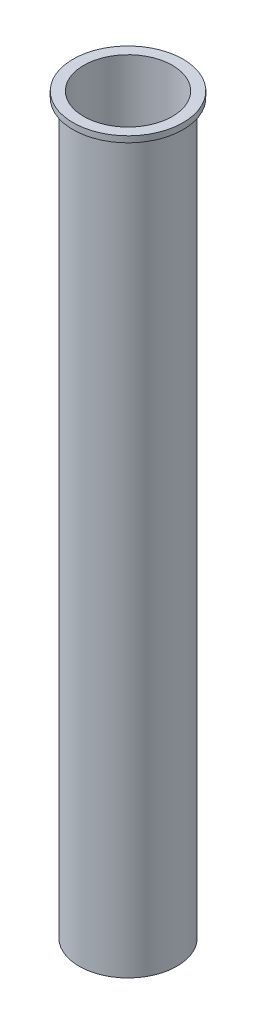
ISO-10303-21;
HEADER;
FILE_DESCRIPTION(('STEP AP214'),'2;1');
FILE_NAME('part.step','',(''),(''),'','','');
FILE_SCHEMA(('AUTOMOTIVE_DESIGN { 1 0 10303 214 1 1 1 1 }'));
ENDSEC;
DATA;
#1=APPLICATION_CONTEXT('core data for automotive mechanical design processes');
#2=APPLICATION_PROTOCOL_DEFINITION('international standard','automotive_design',2000,#1);
#3=PRODUCT_CONTEXT('',#1,'mechanical');
#4=PRODUCT('Part','Part','',(#3));
#5=PRODUCT_RELATED_PRODUCT_CATEGORY('part','',(#4));
#6=PRODUCT_DEFINITION_FORMATION('','',#4);
#7=PRODUCT_DEFINITION_CONTEXT('part definition',#1,'design');
#8=PRODUCT_DEFINITION('design','',#6,#7);
#9=PRODUCT_DEFINITION_SHAPE('','',#8);
#10=(LENGTH_UNIT() NAMED_UNIT(*) SI_UNIT(.MILLI.,.METRE.));
#11=(NAMED_UNIT(*) PLANE_ANGLE_UNIT() SI_UNIT($,.RADIAN.));
#12=(NAMED_UNIT(*) SI_UNIT($,.STERADIAN.) SOLID_ANGLE_UNIT());
#13=UNCERTAINTY_MEASURE_WITH_UNIT(LENGTH_MEASURE(1.E-05),#10,'distance_accuracy_value','');
#14=(GEOMETRIC_REPRESENTATION_CONTEXT(3) GLOBAL_UNCERTAINTY_ASSIGNED_CONTEXT((#13)) GLOBAL_UNIT_ASSIGNED_CONTEXT((#10,
#11,#12)) REPRESENTATION_CONTEXT('',''));
#15=CARTESIAN_POINT('',(0.,0.,0.));
#16=DIRECTION('',(0.,0.,1.));
#17=DIRECTION('',(1.,0.,0.));
#18=AXIS2_PLACEMENT_3D('',#15,#16,#17);
#19=CARTESIAN_POINT('',(0.,0.,0.));
#20=DIRECTION('',(0.,-1.,0.));
#21=DIRECTION('',(0.,0.,-1.));
#22=AXIS2_PLACEMENT_3D('',#19,#20,#21);
#23=CYLINDRICAL_SURFACE('',#22,114.3);
#24=CARTESIAN_POINT('',(0.,0.,0.));
#25=DIRECTION('',(0.,-1.,0.));
#26=DIRECTION('',(0.,0.,-1.));
#27=AXIS2_PLACEMENT_3D('',#24,#25,#26);
#28=CIRCLE('',#27,114.3);
#29=CARTESIAN_POINT('',(0.,0.,-114.3));
#30=VERTEX_POINT('',#29);
#31=EDGE_CURVE('E62',#30,#30,#28,.T.);
#32=ORIENTED_EDGE('',*,*,#31,.T.);
#33=EDGE_LOOP('',(#32));
#34=FACE_BOUND('',#33,.T.);
#35=CARTESIAN_POINT('',(0.,-12.7,0.));
#36=DIRECTION('',(0.,-1.,0.));
#37=DIRECTION('',(0.,0.,-1.));
#38=AXIS2_PLACEMENT_3D('',#35,#36,#37);
#39=CIRCLE('',#38,114.3);
#40=CARTESIAN_POINT('',(0.,-12.7,-114.3));
#41=VERTEX_POINT('',#40);
#42=EDGE_CURVE('E10',#41,#41,#39,.T.);
#43=ORIENTED_EDGE('',*,*,#42,.F.);
#44=EDGE_LOOP('',(#43));
#45=FACE_BOUND('',#44,.T.);
#46=ADVANCED_FACE('F31',(#34,#45),#23,.T.);
#47=CARTESIAN_POINT('',(0.,-12.7,-114.3));
#48=DIRECTION('',(0.,-1.,0.));
#49=DIRECTION('',(0.,0.,-1.));
#50=AXIS2_PLACEMENT_3D('',#47,#48,#49);
#51=PLANE('',#50);
#52=ORIENTED_EDGE('',*,*,#42,.T.);
#53=EDGE_LOOP('',(#52));
#54=FACE_BOUND('',#53,.T.);
#55=CARTESIAN_POINT('',(0.,-12.7,0.));
#56=DIRECTION('',(0.,-1.,0.));
#57=DIRECTION('',(0.,0.,-1.));
#58=AXIS2_PLACEMENT_3D('',#55,#56,#57);
#59=CIRCLE('',#58,101.6);
#60=CARTESIAN_POINT('',(0.,-12.7,-101.6));
#61=VERTEX_POINT('',#60);
#62=EDGE_CURVE('E37',#61,#61,#59,.T.);
#63=ORIENTED_EDGE('',*,*,#62,.F.);
#64=EDGE_LOOP('',(#63));
#65=FACE_BOUND('',#64,.T.);
#66=ADVANCED_FACE('F85',(#54,#65),#51,.T.);
#67=CARTESIAN_POINT('',(0.,0.,0.));
#68=DIRECTION('',(0.,-1.,0.));
#69=DIRECTION('',(0.,0.,-1.));
#70=AXIS2_PLACEMENT_3D('',#67,#68,#69);
#71=CYLINDRICAL_SURFACE('',#70,101.6);
#72=ORIENTED_EDGE('',*,*,#62,.T.);
#73=EDGE_LOOP('',(#72));
#74=FACE_BOUND('',#73,.T.);
#75=CARTESIAN_POINT('',(0.,-1524.,0.));
#76=DIRECTION('',(0.,-1.,0.));
#77=DIRECTION('',(0.,0.,-1.));
#78=AXIS2_PLACEMENT_3D('',#75,#76,#77);
#79=CIRCLE('',#78,101.6);
#80=CARTESIAN_POINT('',(0.,-1524.,-101.6));
#81=VERTEX_POINT('',#80);
#82=EDGE_CURVE('E41',#81,#81,#79,.T.);
#83=ORIENTED_EDGE('',*,*,#82,.F.);
#84=EDGE_LOOP('',(#83));
#85=FACE_BOUND('',#84,.T.);
#86=ADVANCED_FACE('F82',(#74,#85),#71,.T.);
#87=CARTESIAN_POINT('',(0.,-1524.,-101.6));
#88=DIRECTION('',(0.,-1.,0.));
#89=DIRECTION('',(0.,0.,-1.));
#90=AXIS2_PLACEMENT_3D('',#87,#88,#89);
#91=PLANE('',#90);
#92=ORIENTED_EDGE('',*,*,#82,.T.);
#93=EDGE_LOOP('',(#92));
#94=FACE_BOUND('',#93,.T.);
#95=CARTESIAN_POINT('',(0.,-1524.,0.));
#96=DIRECTION('',(0.,-1.,0.));
#97=DIRECTION('',(0.,0.,-1.));
#98=AXIS2_PLACEMENT_3D('',#95,#96,#97);
#99=CIRCLE('',#98,96.5233767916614);
#100=CARTESIAN_POINT('',(0.,-1524.,-96.5233767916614));
#101=VERTEX_POINT('',#100);
#102=EDGE_CURVE('E45',#101,#101,#99,.T.);
#103=ORIENTED_EDGE('',*,*,#102,.F.);
#104=EDGE_LOOP('',(#103));
#105=FACE_BOUND('',#104,.T.);
#106=ADVANCED_FACE('F77',(#94,#105),#91,.T.);
#107=CARTESIAN_POINT('',(0.,-1460.5,-12.7));
#108=CARTESIAN_POINT('',(0.,-1481.26134861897,-12.7));
#109=CARTESIAN_POINT('',(0.,-1525.21465995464,-25.1026093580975));
#110=CARTESIAN_POINT('',(0.,-1524.,-71.1785006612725));
#111=CARTESIAN_POINT('',(0.,-1524.,-96.5233767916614));
#112=B_SPLINE_CURVE_WITH_KNOTS('',3,(#107,#108,#109,#110,#111),.UNSPECIFIED.,.F.,.F.,(4,1,4),
(0.,0.444656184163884,1.),.UNSPECIFIED.);
#113=CARTESIAN_POINT('',(0.,0.,0.));
#114=DIRECTION('',(0.,-1.,0.));
#115=AXIS1_PLACEMENT('',#113,#114);
#116=SURFACE_OF_REVOLUTION('',#112,#115);
#117=ORIENTED_EDGE('',*,*,#102,.T.);
#118=EDGE_LOOP('',(#117));
#119=FACE_BOUND('',#118,.T.);
#120=CARTESIAN_POINT('',(0.,-1460.5,0.));
#121=DIRECTION('',(0.,-1.,0.));
#122=DIRECTION('',(0.,0.,-1.));
#123=AXIS2_PLACEMENT_3D('',#120,#121,#122);
#124=CIRCLE('',#123,12.7);
#125=CARTESIAN_POINT('',(0.,-1460.5,-12.7));
#126=VERTEX_POINT('',#125);
#127=EDGE_CURVE('E50',#126,#126,#124,.T.);
#128=ORIENTED_EDGE('',*,*,#127,.F.);
#129=EDGE_LOOP('',(#128));
#130=FACE_BOUND('',#129,.T.);
#131=ADVANCED_FACE('F72',(#119,#130),#116,.F.);
#132=CARTESIAN_POINT('',(0.,0.,0.));
#133=DIRECTION('',(0.,-1.,0.));
#134=DIRECTION('',(0.,0.,-1.));
#135=AXIS2_PLACEMENT_3D('',#132,#133,#134);
#136=CYLINDRICAL_SURFACE('',#135,12.7);
#137=ORIENTED_EDGE('',*,*,#127,.T.);
#138=EDGE_LOOP('',(#137));
#139=FACE_BOUND('',#138,.T.);
#140=CARTESIAN_POINT('',(0.,-1447.8,0.));
#141=DIRECTION('',(0.,-1.,0.));
#142=DIRECTION('',(0.,0.,-1.));
#143=AXIS2_PLACEMENT_3D('',#140,#141,#142);
#144=CIRCLE('',#143,12.7);
#145=CARTESIAN_POINT('',(0.,-1447.8,-12.7));
#146=VERTEX_POINT('',#145);
#147=EDGE_CURVE('E53',#146,#146,#144,.T.);
#148=ORIENTED_EDGE('',*,*,#147,.F.);
#149=EDGE_LOOP('',(#148));
#150=FACE_BOUND('',#149,.T.);
#151=ADVANCED_FACE('F76',(#139,#150),#136,.F.);
#152=CARTESIAN_POINT('',(0.,-1447.8,-12.7));
#153=DIRECTION('',(0.,1.,0.));
#154=DIRECTION('',(0.,0.,1.));
#155=AXIS2_PLACEMENT_3D('',#152,#153,#154);
#156=PLANE('',#155);
#157=ORIENTED_EDGE('',*,*,#147,.T.);
#158=EDGE_LOOP('',(#157));
#159=FACE_BOUND('',#158,.T.);
#160=CARTESIAN_POINT('',(0.,-1447.8,0.));
#161=DIRECTION('',(0.,-1.,0.));
#162=DIRECTION('',(0.,0.,-1.));
#163=AXIS2_PLACEMENT_3D('',#160,#161,#162);
#164=CIRCLE('',#163,92.0750000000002);
#165=CARTESIAN_POINT('',(0.,-1447.8,-92.0750000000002));
#166=VERTEX_POINT('',#165);
#167=EDGE_CURVE('E56',#166,#166,#164,.T.);
#168=ORIENTED_EDGE('',*,*,#167,.F.);
#169=EDGE_LOOP('',(#168));
#170=FACE_BOUND('',#169,.T.);
#171=ADVANCED_FACE('F105',(#159,#170),#156,.T.);
#172=CARTESIAN_POINT('',(0.,0.,0.));
#173=DIRECTION('',(0.,-1.,0.));
#174=DIRECTION('',(0.,0.,-1.));
#175=AXIS2_PLACEMENT_3D('',#172,#173,#174);
#176=CYLINDRICAL_SURFACE('',#175,92.0750000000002);
#177=ORIENTED_EDGE('',*,*,#167,.T.);
#178=EDGE_LOOP('',(#177));
#179=FACE_BOUND('',#178,.T.);
#180=CARTESIAN_POINT('',(0.,0.,0.));
#181=DIRECTION('',(0.,-1.,0.));
#182=DIRECTION('',(0.,0.,-1.));
#183=AXIS2_PLACEMENT_3D('',#180,#181,#182);
#184=CIRCLE('',#183,92.0750000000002);
#185=CARTESIAN_POINT('',(0.,0.,-92.0750000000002));
#186=VERTEX_POINT('',#185);
#187=EDGE_CURVE('E59',#186,#186,#184,.T.);
#188=ORIENTED_EDGE('',*,*,#187,.F.);
#189=EDGE_LOOP('',(#188));
#190=FACE_BOUND('',#189,.T.);
#191=ADVANCED_FACE('F99',(#179,#190),#176,.F.);
#192=CARTESIAN_POINT('',(0.,0.,-92.0750000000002));
#193=DIRECTION('',(0.,1.,0.));
#194=DIRECTION('',(0.,0.,1.));
#195=AXIS2_PLACEMENT_3D('',#192,#193,#194);
#196=PLANE('',#195);
#197=ORIENTED_EDGE('',*,*,#187,.T.);
#198=EDGE_LOOP('',(#197));
#199=FACE_BOUND('',#198,.T.);
#200=ORIENTED_EDGE('',*,*,#31,.F.);
#201=EDGE_LOOP('',(#200));
#202=FACE_BOUND('',#201,.T.);
#203=ADVANCED_FACE('F97',(#199,#202),#196,.T.);
#204=CLOSED_SHELL('',(#46,#66,#86,#106,#131,#151,#171,#191,#203));
#205=MANIFOLD_SOLID_BREP('B2',#204);
#206=ADVANCED_BREP_SHAPE_REPRESENTATION('',(#18,#205),#14);
#207=SHAPE_DEFINITION_REPRESENTATION(#9,#206);
ENDSEC;
END-ISO-10303-21;
